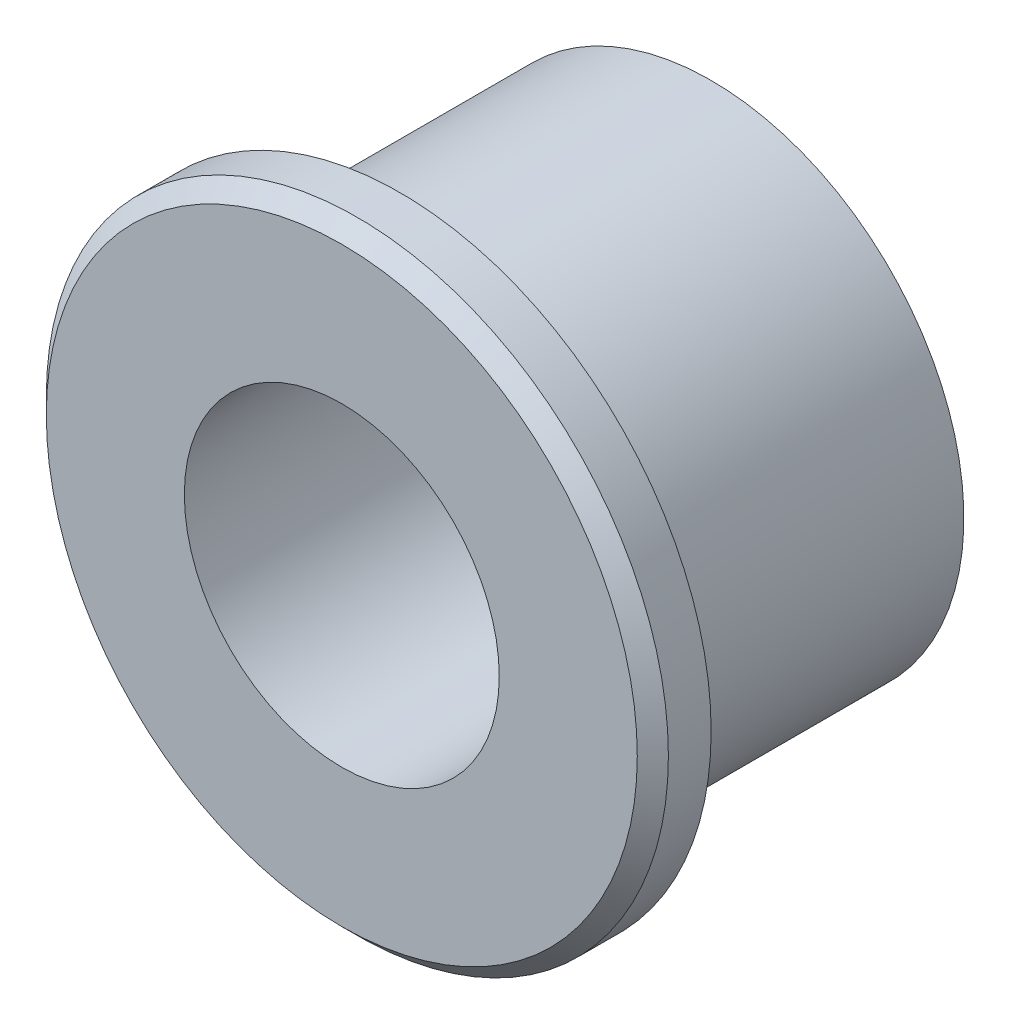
ISO-10303-21;
HEADER;
FILE_DESCRIPTION(('STEP AP214'),'2;1');
FILE_NAME('part.step','',(''),(''),'','','');
FILE_SCHEMA(('AUTOMOTIVE_DESIGN { 1 0 10303 214 1 1 1 1 }'));
ENDSEC;
DATA;
#1=APPLICATION_CONTEXT('core data for automotive mechanical design processes');
#2=APPLICATION_PROTOCOL_DEFINITION('international standard','automotive_design',2000,#1);
#3=PRODUCT_CONTEXT('',#1,'mechanical');
#4=PRODUCT('Part','Part','',(#3));
#5=PRODUCT_RELATED_PRODUCT_CATEGORY('part','',(#4));
#6=PRODUCT_DEFINITION_FORMATION('','',#4);
#7=PRODUCT_DEFINITION_CONTEXT('part definition',#1,'design');
#8=PRODUCT_DEFINITION('design','',#6,#7);
#9=PRODUCT_DEFINITION_SHAPE('','',#8);
#10=(LENGTH_UNIT() NAMED_UNIT(*) SI_UNIT(.MILLI.,.METRE.));
#11=(NAMED_UNIT(*) PLANE_ANGLE_UNIT() SI_UNIT($,.RADIAN.));
#12=(NAMED_UNIT(*) SI_UNIT($,.STERADIAN.) SOLID_ANGLE_UNIT());
#13=UNCERTAINTY_MEASURE_WITH_UNIT(LENGTH_MEASURE(1.E-05),#10,'distance_accuracy_value','');
#14=(GEOMETRIC_REPRESENTATION_CONTEXT(3) GLOBAL_UNCERTAINTY_ASSIGNED_CONTEXT((#13)) GLOBAL_UNIT_ASSIGNED_CONTEXT((#10,
#11,#12)) REPRESENTATION_CONTEXT('',''));
#15=CARTESIAN_POINT('',(0.,0.,0.));
#16=DIRECTION('',(0.,0.,1.));
#17=DIRECTION('',(1.,0.,0.));
#18=AXIS2_PLACEMENT_3D('',#15,#16,#17);
#19=CARTESIAN_POINT('',(0.,0.,0.));
#20=DIRECTION('',(0.,0.,-1.));
#21=DIRECTION('',(-1.,0.,0.));
#22=AXIS2_PLACEMENT_3D('',#19,#20,#21);
#23=PLANE('',#22);
#24=CARTESIAN_POINT('',(0.,0.,0.));
#25=DIRECTION('',(0.,0.,1.));
#26=DIRECTION('',(1.,0.,0.));
#27=AXIS2_PLACEMENT_3D('',#24,#25,#26);
#28=CIRCLE('',#27,6.9);
#29=CARTESIAN_POINT('',(6.9,0.,0.));
#30=VERTEX_POINT('',#29);
#31=EDGE_CURVE('E16',#30,#30,#28,.F.);
#32=ORIENTED_EDGE('',*,*,#31,.F.);
#33=EDGE_LOOP('',(#32));
#34=FACE_BOUND('',#33,.T.);
#35=CARTESIAN_POINT('',(0.,0.,0.));
#36=DIRECTION('',(0.,0.,1.));
#37=DIRECTION('',(1.,0.,0.));
#38=AXIS2_PLACEMENT_3D('',#35,#36,#37);
#39=CIRCLE('',#38,8.);
#40=CARTESIAN_POINT('',(8.,0.,0.));
#41=VERTEX_POINT('',#40);
#42=EDGE_CURVE('E36',#41,#41,#39,.T.);
#43=ORIENTED_EDGE('',*,*,#42,.F.);
#44=EDGE_LOOP('',(#43));
#45=FACE_BOUND('',#44,.T.);
#46=ADVANCED_FACE('F12',(#34,#45),#23,.T.);
#47=CARTESIAN_POINT('',(0.,0.,-0.4));
#48=DIRECTION('',(0.,0.,1.));
#49=DIRECTION('',(1.,0.,0.));
#50=AXIS2_PLACEMENT_3D('',#47,#48,#49);
#51=TOROIDAL_SURFACE('',#50,6.9,0.4);
#52=CARTESIAN_POINT('',(0.,0.,-0.4));
#53=DIRECTION('',(0.,0.,-1.));
#54=DIRECTION('',(1.,0.,0.));
#55=AXIS2_PLACEMENT_3D('',#52,#53,#54);
#56=CIRCLE('',#55,6.5);
#57=CARTESIAN_POINT('',(6.5,0.,-0.4));
#58=VERTEX_POINT('',#57);
#59=EDGE_CURVE('E28',#58,#58,#56,.T.);
#60=ORIENTED_EDGE('',*,*,#59,.F.);
#61=EDGE_LOOP('',(#60));
#62=FACE_BOUND('',#61,.T.);
#63=ORIENTED_EDGE('',*,*,#31,.T.);
#64=EDGE_LOOP('',(#63));
#65=FACE_BOUND('',#64,.T.);
#66=ADVANCED_FACE('F44',(#62,#65),#51,.F.);
#67=CARTESIAN_POINT('',(0.,0.,0.));
#68=DIRECTION('',(0.,0.,1.));
#69=DIRECTION('',(1.,0.,0.));
#70=AXIS2_PLACEMENT_3D('',#67,#68,#69);
#71=CYLINDRICAL_SURFACE('',#70,8.);
#72=CARTESIAN_POINT('',(0.,0.,1.09999999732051));
#73=DIRECTION('',(0.,0.,-1.));
#74=DIRECTION('',(-1.,0.,0.));
#75=AXIS2_PLACEMENT_3D('',#72,#73,#74);
#76=CIRCLE('',#75,7.99999999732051);
#77=CARTESIAN_POINT('',(-7.99999999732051,0.,1.09999999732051));
#78=VERTEX_POINT('',#77);
#79=EDGE_CURVE('E35',#78,#78,#76,.F.);
#80=ORIENTED_EDGE('',*,*,#79,.F.);
#81=EDGE_LOOP('',(#80));
#82=FACE_BOUND('',#81,.T.);
#83=ORIENTED_EDGE('',*,*,#42,.T.);
#84=EDGE_LOOP('',(#83));
#85=FACE_BOUND('',#84,.T.);
#86=ADVANCED_FACE('F53',(#82,#85),#71,.T.);
#87=CARTESIAN_POINT('',(0.,0.,-0.4));
#88=DIRECTION('',(0.,0.,-1.));
#89=DIRECTION('',(-1.,0.,0.));
#90=AXIS2_PLACEMENT_3D('',#87,#88,#89);
#91=CYLINDRICAL_SURFACE('',#90,6.5);
#92=CARTESIAN_POINT('',(0.,0.,-8.));
#93=DIRECTION('',(0.,0.,-1.));
#94=DIRECTION('',(-1.,0.,0.));
#95=AXIS2_PLACEMENT_3D('',#92,#93,#94);
#96=CIRCLE('',#95,6.5);
#97=CARTESIAN_POINT('',(-6.5,0.,-8.));
#98=VERTEX_POINT('',#97);
#99=EDGE_CURVE('E33',#98,#98,#96,.T.);
#100=ORIENTED_EDGE('',*,*,#99,.F.);
#101=EDGE_LOOP('',(#100));
#102=FACE_BOUND('',#101,.T.);
#103=ORIENTED_EDGE('',*,*,#59,.T.);
#104=EDGE_LOOP('',(#103));
#105=FACE_BOUND('',#104,.T.);
#106=ADVANCED_FACE('F73',(#102,#105),#91,.T.);
#107=CARTESIAN_POINT('',(0.,0.,1.50000000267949));
#108=DIRECTION('',(0.,0.,-1.));
#109=DIRECTION('',(-1.,0.,0.));
#110=AXIS2_PLACEMENT_3D('',#107,#108,#109);
#111=CONICAL_SURFACE('',#110,7.60000000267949,0.785398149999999);
#112=CARTESIAN_POINT('',(0.,0.,1.50000000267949));
#113=DIRECTION('',(0.,0.,-1.));
#114=DIRECTION('',(-1.,0.,0.));
#115=AXIS2_PLACEMENT_3D('',#112,#113,#114);
#116=CIRCLE('',#115,7.60000000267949);
#117=CARTESIAN_POINT('',(-7.60000000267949,0.,1.50000000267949));
#118=VERTEX_POINT('',#117);
#119=EDGE_CURVE('E25',#118,#118,#116,.F.);
#120=ORIENTED_EDGE('',*,*,#119,.F.);
#121=EDGE_LOOP('',(#120));
#122=FACE_BOUND('',#121,.T.);
#123=ORIENTED_EDGE('',*,*,#79,.T.);
#124=EDGE_LOOP('',(#123));
#125=FACE_BOUND('',#124,.T.);
#126=ADVANCED_FACE('F69',(#122,#125),#111,.T.);
#127=CARTESIAN_POINT('',(0.,0.,-8.));
#128=DIRECTION('',(0.,0.,-1.));
#129=DIRECTION('',(-1.,0.,0.));
#130=AXIS2_PLACEMENT_3D('',#127,#128,#129);
#131=PLANE('',#130);
#132=CARTESIAN_POINT('',(0.,0.,-8.));
#133=DIRECTION('',(0.,0.,-1.));
#134=DIRECTION('',(-1.,0.,0.));
#135=AXIS2_PLACEMENT_3D('',#132,#133,#134);
#136=CIRCLE('',#135,4.05);
#137=CARTESIAN_POINT('',(-4.05,0.,-8.));
#138=VERTEX_POINT('',#137);
#139=EDGE_CURVE('E20',#138,#138,#136,.T.);
#140=ORIENTED_EDGE('',*,*,#139,.F.);
#141=EDGE_LOOP('',(#140));
#142=FACE_BOUND('',#141,.T.);
#143=ORIENTED_EDGE('',*,*,#99,.T.);
#144=EDGE_LOOP('',(#143));
#145=FACE_BOUND('',#144,.T.);
#146=ADVANCED_FACE('F62',(#142,#145),#131,.T.);
#147=CARTESIAN_POINT('',(0.,0.,1.5));
#148=DIRECTION('',(0.,0.,1.));
#149=DIRECTION('',(1.,0.,0.));
#150=AXIS2_PLACEMENT_3D('',#147,#148,#149);
#151=PLANE('',#150);
#152=CARTESIAN_POINT('',(0.,0.,1.5));
#153=DIRECTION('',(0.,0.,-1.));
#154=DIRECTION('',(-1.,0.,0.));
#155=AXIS2_PLACEMENT_3D('',#152,#153,#154);
#156=CIRCLE('',#155,4.05);
#157=CARTESIAN_POINT('',(-4.05,0.,1.5));
#158=VERTEX_POINT('',#157);
#159=EDGE_CURVE('E8',#158,#158,#156,.F.);
#160=ORIENTED_EDGE('',*,*,#159,.F.);
#161=EDGE_LOOP('',(#160));
#162=FACE_BOUND('',#161,.T.);
#163=ORIENTED_EDGE('',*,*,#119,.T.);
#164=EDGE_LOOP('',(#163));
#165=FACE_BOUND('',#164,.T.);
#166=ADVANCED_FACE('F57',(#162,#165),#151,.T.);
#167=CARTESIAN_POINT('',(0.,0.,1.5));
#168=DIRECTION('',(0.,0.,-1.));
#169=DIRECTION('',(-1.,0.,0.));
#170=AXIS2_PLACEMENT_3D('',#167,#168,#169);
#171=CYLINDRICAL_SURFACE('',#170,4.05);
#172=ORIENTED_EDGE('',*,*,#139,.T.);
#173=EDGE_LOOP('',(#172));
#174=FACE_BOUND('',#173,.T.);
#175=ORIENTED_EDGE('',*,*,#159,.T.);
#176=EDGE_LOOP('',(#175));
#177=FACE_BOUND('',#176,.T.);
#178=ADVANCED_FACE('F14',(#174,#177),#171,.F.);
#179=CLOSED_SHELL('',(#46,#66,#86,#106,#126,#146,#166,#178));
#180=MANIFOLD_SOLID_BREP('B1',#179);
#181=ADVANCED_BREP_SHAPE_REPRESENTATION('',(#18,#180),#14);
#182=SHAPE_DEFINITION_REPRESENTATION(#9,#181);
ENDSEC;
END-ISO-10303-21;
